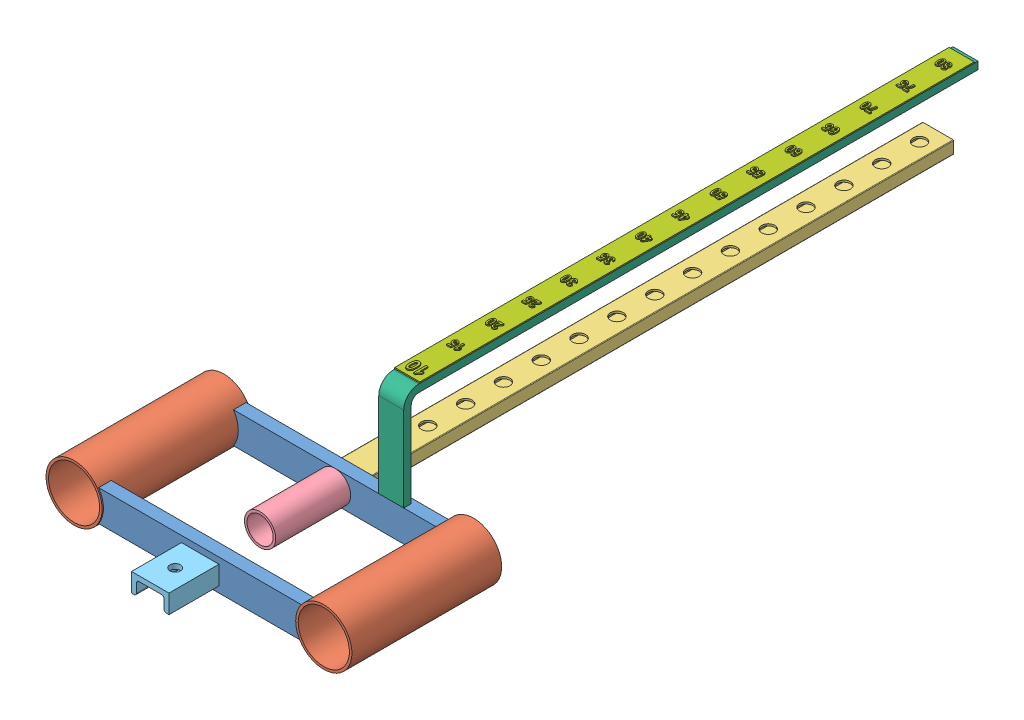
SolidWorks assembly BARRE DE SELECTION MECANO SOUDEE.SLDASM, configuration Défaut (file format 4400). Lengths in mm.
Overall size (245 117 631).
9 component instances, 7 part files, 23 mates.
Components (placement in the parent):
- Barre de sélection TRAVERSE-1: Barre de sélection TRAVERSE.SLDPRT [Défaut] at origin size (162.58 25 10)
- Barre de sélection TUBE DE GUIDAGE-1: Barre de sélection TUBE DE GUIDAGE.SLDPRT [Défaut] at (-100 0 -1) size (45 45 120)
- Barre de sélection TUBE DE GUIDAGE-2: Barre de sélection TUBE DE GUIDAGE.SLDPRT [Défaut] at (100 0 -1) size (45 45 120)
- Barre de sélection TRAVERSE-2: Barre de sélection TRAVERSE.SLDPRT [Défaut] at (0 0 108) size (162.58 25 10)
- Barre de sélection PLONGEUR DE SELECTION-1: Barre de sélection PLONGEUR DE SELECTION.SLDPRT [Défaut] x (1 0 0) z (0 0 -1) size (25 10 473)
- Barre de sélection POIGNEE-1: Barre de sélection POIGNEE.SLDPRT [Défaut] at (0 0 10) size (25 25 60)
- Barre de sélection FIXATION DE CABLE-1: Barre de sélection FIXATION DE CABLE.SLDPRT [Défaut] at (0 7.5 118) size (30 15 40)
- Barre de sélection INDEX DE SELECTION-1: Barre de sélection INDEX DE SELECTION.SLDPRT [Défaut] at (55 80.5 -2) x (0 -1 0) z (-1 0 0) size (80 460 20)
- Autocollant plaque 5 KG-120 Kg 15 x 720 mm_80 kg-2: Autocollant plaque 5 KG-120 Kg 15 x 720 mm_80 kg.sldprt [Défaut] at (45.2748 92.5 5.0236) x (-1 0 0) z (0 1 0) size (20.11 444.09 2)
Mates (geometry in assembly coordinates):
- Coaxiale1: concentric aligned: cylinder of Barre de sélection TRAVERSE-1 through (-100 0 10) axis (0 0 -1) radius 22.5; cylinder of Barre de sélection TUBE DE GUIDAGE-1 through (-100 0 119) axis (0 0 -1) radius 22.5
- Coaxiale2: concentric aligned: cylinder of Barre de sélection TRAVERSE-1 through (100 0 10) axis (0 0 -1) radius 22.5; cylinder of Barre de sélection TUBE DE GUIDAGE-2 through (100 0 119) axis (0 0 -1) radius 22.5
- Coïncidente2: coincident aligned: plane of Barre de sélection TUBE DE GUIDAGE-1 through (-100 0 -1) normal (0 0 -1); plane of Barre de sélection TUBE DE GUIDAGE-2 through (100 0 -1) normal (0 0 -1)
- Distance1: distance = 1 mm aligned: plane of Barre de sélection TUBE DE GUIDAGE-2 through (100 0 -1) normal (0 0 -1); plane of Barre de sélection TRAVERSE-1 through (-100 0 0) normal (0 0 -1)
- Coaxiale3: concentric aligned: cylinder of Barre de sélection TUBE DE GUIDAGE-1 through (-100 0 119) axis (0 0 -1) radius 22.5; cylinder of Barre de sélection TRAVERSE-2 through (-100 0 118) axis (0 0 -1) radius 22.5
- Coaxiale4: concentric aligned: cylinder of Barre de sélection TUBE DE GUIDAGE-2 through (100 0 119) axis (0 0 -1) radius 22.5; cylinder of Barre de sélection TRAVERSE-2 through (100 0 118) axis (0 0 -1) radius 22.5
- Distance2: distance = 1 mm aligned: plane of Barre de sélection TRAVERSE-2 through (-100 0 118) normal (0 0 1); plane of Barre de sélection TUBE DE GUIDAGE-1 through (-100 0 119) normal (0 0 1)
- Coïncidente6: coincident: point of Barre de sélection PLONGEUR DE SELECTION-1; point of assembly
- Coïncidente7: coincident anti-aligned: plane of Barre de sélection TRAVERSE-1 through (-100 0 0) normal (0 0 -1); plane of Barre de sélection PLONGEUR DE SELECTION-1 through (12 -4.5 0) normal (0 0 1)
- Parallèle3: parallel aligned: plane of Barre de sélection TRAVERSE-1 through (-81.2917 12.5 10) normal (0 1 0); plane of Barre de sélection PLONGEUR DE SELECTION-1 through (-12 5 -473) normal (0 1 0)
- Coïncidente9: coincident anti-aligned: plane of Barre de sélection TRAVERSE-1 through (-100 0 10) normal (0 0 1); plane of Barre de sélection POIGNEE-1 through (0 0 10) normal (0 0 -1)
- Coïncidente13: coincident: axis of Barre de sélection POIGNEE-1 through (0 0 70) axis (0 0 -1); point of assembly
- Coïncidente14: coincident anti-aligned: plane of Barre de sélection TRAVERSE-2 through (-100 0 118) normal (0 0 1); plane of Barre de sélection FIXATION DE CABLE-1 through (-13 -5.5 118) normal (0 0 -1)
- Coïncidente16: coincident anti-aligned: plane of Barre de sélection TRAVERSE-1 through (-81.2917 12.5 10) normal (0 1 0); plane of Barre de sélection INDEX DE SELECTION-1 through (35 12.5 10) normal (0 -1 0)
- Coïncidente17: coincident aligned: plane of Barre de sélection TRAVERSE-1 through (-100 0 10) normal (0 0 1); plane of Barre de sélection INDEX DE SELECTION-1 through (35 12.5 10) normal (0 0 1)
- Parallèle6: parallel: axis of Barre de sélection POIGNEE-1 through (0 0 70) axis (0 0 -1); plane of Barre de sélection INDEX DE SELECTION-1 through (35 80.5 -2) normal (-1 0 0)
- Distance4: distance = 35 mm: plane of Barre de sélection INDEX DE SELECTION-1 through (35 80.5 -2) normal (-1 0 0); axis of Barre de sélection POIGNEE-1 through (0 0 70) axis (0 0 -1)
- Coïncidente19: coincident anti-aligned: plane of Barre de sélection INDEX DE SELECTION-1 through (35 92.5 -2) normal (0 1 0); plane of Autocollant plaque 5 KG-120 Kg 15 x 720 mm_80 kg-2 through (55 92.5 -590.1255) normal (0 -1 0)
- Parallèle13: parallel aligned: line of Barre de sélection INDEX DE SELECTION-1 through (55 92.5 -2) axis (0 0 -1); line of Autocollant plaque 5 KG-120 Kg 15 x 720 mm_80 kg-2 through (55 93.5 -2.9087) axis (0 0 -1)
- Distance9: distance = 3 mm: line of Autocollant plaque 5 KG-120 Kg 15 x 720 mm_80 kg-2 through (55 92.5 -447) axis (-1 0 0); line of Barre de sélection INDEX DE SELECTION-1 through (35 92.5 -450) axis (1 0 0)
- Coïncidente24: coincident aligned: plane of Barre de sélection INDEX DE SELECTION-1 through (55 80.5 -2) normal (1 0 0); plane of Autocollant plaque 5 KG-120 Kg 15 x 720 mm_80 kg-2 through (55 93.5 -2.9087) normal (1 0 0)
- Distance14: distance = 85 mm: axis of Barre de sélection TUBE DE GUIDAGE-1 through (-100 0 119) axis (0 0 -1); line of Barre de sélection FIXATION DE CABLE-1 through (-15 7.5 158) axis (0 -1 0)
- Distance16: distance = 5 mm aligned: plane of Barre de sélection TRAVERSE-2 through (-81.2917 12.5 118) normal (0 1 0); plane of Barre de sélection FIXATION DE CABLE-1 through (15 7.5 158) normal (0 1 0)
